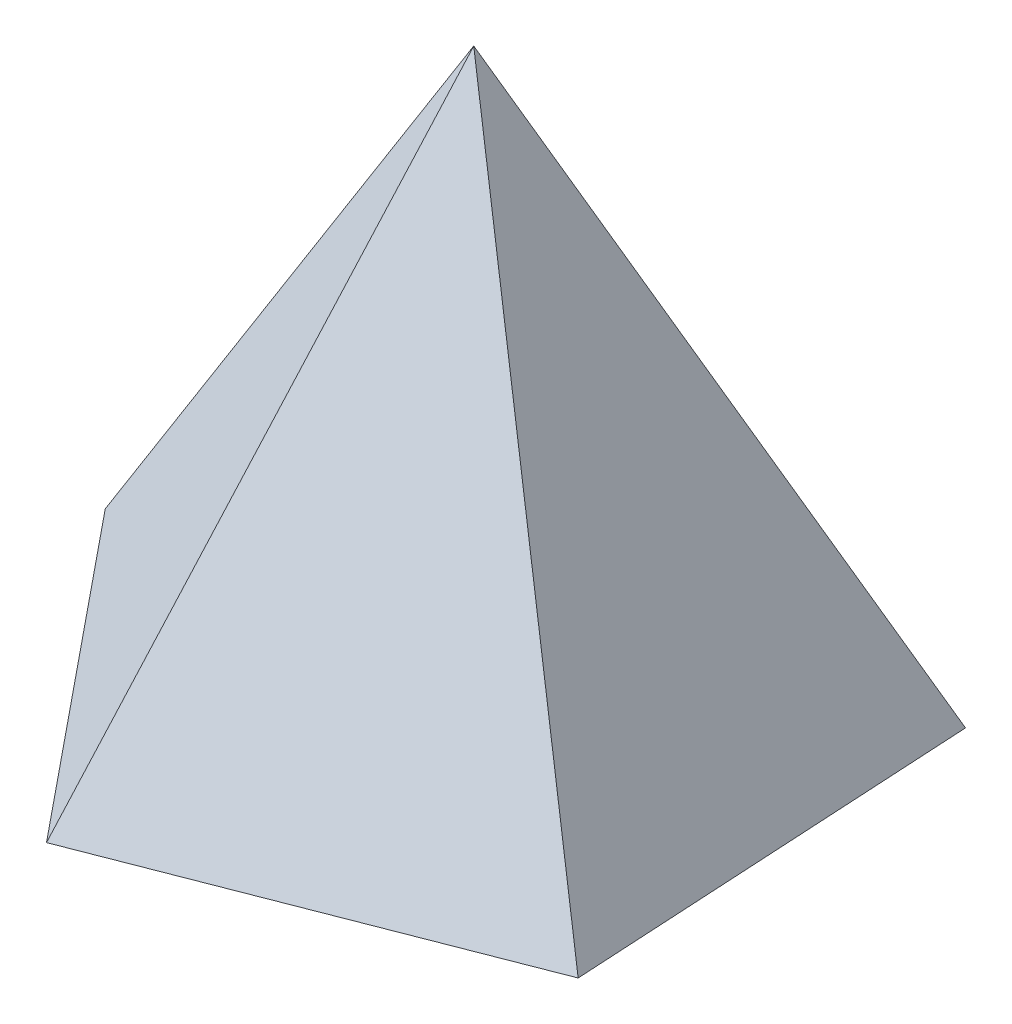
from build123d import *


with BuildPart() as part:
    # Sketch 1 → Loft 1 section 0
    with BuildSketch(Plane(origin=(0, 0, 0), x_dir=(1, 0, 0), z_dir=(0, 1, 0)), mode=Mode.PRIVATE) as loft_1_s0:
        with BuildLine():
            Line((51.948627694, -33.481340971), (47.895656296, 39.059777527))
            Line((47.895656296, 39.059777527), (-22.34748419, 57.621611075))
            Line((-22.34748419, 57.621611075), (-61.707161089, -3.447663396))
            Line((-61.707161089, -3.447663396), (-15.789638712, -59.752384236))
            Line((-15.789638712, -59.752384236), (51.948627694, -33.481340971))
        make_face()
    loft([Vertex(0, 100, 0), loft_1_s0.sketch])


solid = part.part
